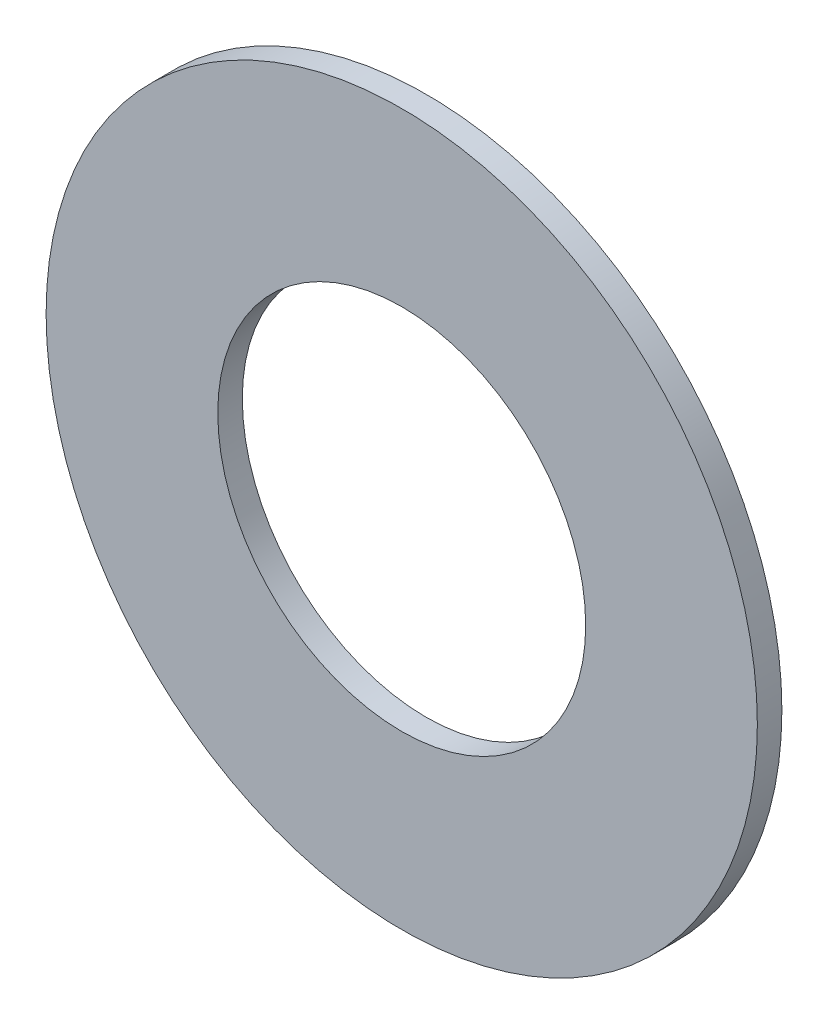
from build123d import *

# Parameters (mm, degrees)
SKETCH2_R           = 46.032669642
SKETCH2_R_2         = 23.8125
BOSS_EXTRUDE1_DEPTH = 1.5875


with BuildPart() as part:
    # Sketch2 → Boss-Extrude1 (new, symmetric)
    with BuildSketch(Plane(origin=(0, 0, 0), x_dir=(0, 1, 0), z_dir=(0, 0, 1))):
        with Locations(Location((0, 0, 0), (0, 0, 270))):
            Circle(SKETCH2_R)
        with Locations(Location((0, 0, 0), (0, 0, 270))):
            Circle(SKETCH2_R_2, mode=Mode.SUBTRACT)
    extrude(amount=BOSS_EXTRUDE1_DEPTH, both=True)


solid = part.part
